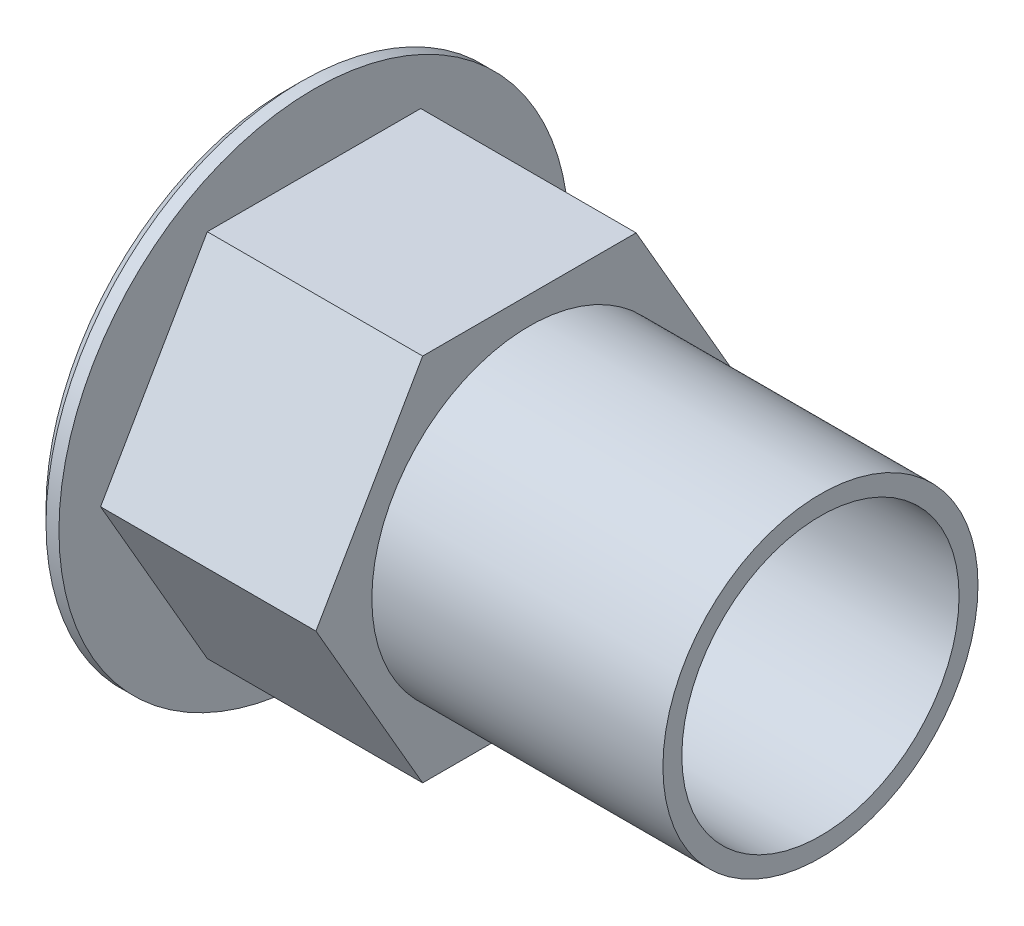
from build123d import *

# Parameters (mm, degrees)
EXTRUDE1_START = 7.399
SKETCH2_R      = 5.4125
EXTRUDE1_DEPTH = 7.399


with BuildPart() as part:
    # Sketch1 → Revolve1 (revolve)
    with BuildSketch(Plane.XY, mode=Mode.PRIVATE) as revolve1_sk:
        Polygon((0, 4.7625), (0, 8.3185), (0.4445, 8.763), (0.889, 8.763), (0.889, 5.4125), (18.288, 5.4125), (18.288, 4.7625), align=None)
    revolve(revolve1_sk.sketch.rotate(Axis((0, 0, 0), (1, 0, 0)), 90), axis=Axis((0, 0, 0), (1, 0, 0)))

    # Sketch2 → Extrude1 (add)
    with BuildSketch(Plane(origin=(0.889, 0, 0), x_dir=(0, 0, -1), z_dir=(1, 0, 0)).offset(EXTRUDE1_START)):
        Polygon((7.332348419, 0), (3.666174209, 6.35), (-3.666174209, 6.35), (-7.332348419, 0), (-3.666174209, -6.35), (3.666174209, -6.35), align=None)
        with Locations(Location((0, 0, 0), (0, 0, 180))):
            Circle(SKETCH2_R, mode=Mode.SUBTRACT)
    extrude(amount=-EXTRUDE1_DEPTH)


solid = part.part
